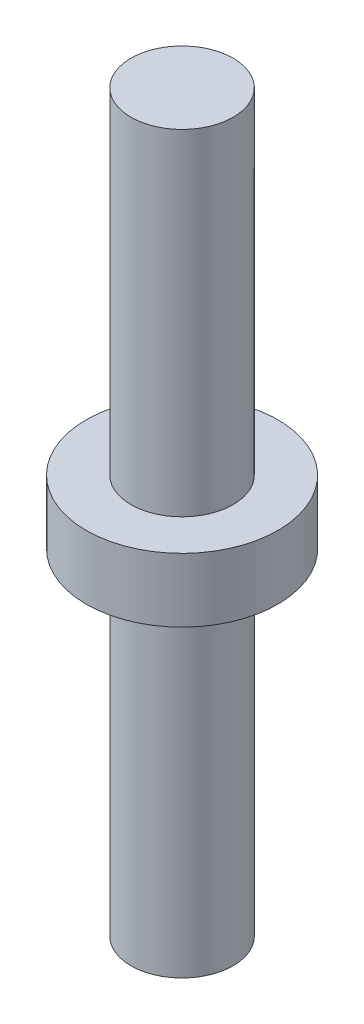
ISO-10303-21;
HEADER;
FILE_DESCRIPTION(('STEP AP214'),'2;1');
FILE_NAME('part.step','',(''),(''),'','','');
FILE_SCHEMA(('AUTOMOTIVE_DESIGN { 1 0 10303 214 1 1 1 1 }'));
ENDSEC;
DATA;
#1=APPLICATION_CONTEXT('core data for automotive mechanical design processes');
#2=APPLICATION_PROTOCOL_DEFINITION('international standard','automotive_design',2000,#1);
#3=PRODUCT_CONTEXT('',#1,'mechanical');
#4=PRODUCT('Part','Part','',(#3));
#5=PRODUCT_RELATED_PRODUCT_CATEGORY('part','',(#4));
#6=PRODUCT_DEFINITION_FORMATION('','',#4);
#7=PRODUCT_DEFINITION_CONTEXT('part definition',#1,'design');
#8=PRODUCT_DEFINITION('design','',#6,#7);
#9=PRODUCT_DEFINITION_SHAPE('','',#8);
#10=(LENGTH_UNIT() NAMED_UNIT(*) SI_UNIT(.MILLI.,.METRE.));
#11=(NAMED_UNIT(*) PLANE_ANGLE_UNIT() SI_UNIT($,.RADIAN.));
#12=(NAMED_UNIT(*) SI_UNIT($,.STERADIAN.) SOLID_ANGLE_UNIT());
#13=UNCERTAINTY_MEASURE_WITH_UNIT(LENGTH_MEASURE(1.E-05),#10,'distance_accuracy_value','');
#14=(GEOMETRIC_REPRESENTATION_CONTEXT(3) GLOBAL_UNCERTAINTY_ASSIGNED_CONTEXT((#13)) GLOBAL_UNIT_ASSIGNED_CONTEXT((#10,
#11,#12)) REPRESENTATION_CONTEXT('',''));
#15=CARTESIAN_POINT('',(0.,0.,0.));
#16=DIRECTION('',(0.,0.,1.));
#17=DIRECTION('',(1.,0.,0.));
#18=AXIS2_PLACEMENT_3D('',#15,#16,#17);
#19=CARTESIAN_POINT('',(0.,2.,0.));
#20=DIRECTION('',(0.,-1.,0.));
#21=DIRECTION('',(0.,0.,-1.));
#22=AXIS2_PLACEMENT_3D('',#19,#20,#21);
#23=CYLINDRICAL_SURFACE('',#22,3.);
#24=CARTESIAN_POINT('',(0.,2.,0.));
#25=DIRECTION('',(0.,1.,0.));
#26=DIRECTION('',(0.,0.,1.));
#27=AXIS2_PLACEMENT_3D('',#24,#25,#26);
#28=CIRCLE('',#27,3.);
#29=CARTESIAN_POINT('',(0.,2.,3.));
#30=VERTEX_POINT('',#29);
#31=EDGE_CURVE('E51',#30,#30,#28,.T.);
#32=ORIENTED_EDGE('',*,*,#31,.F.);
#33=EDGE_LOOP('',(#32));
#34=FACE_BOUND('',#33,.T.);
#35=CARTESIAN_POINT('',(0.,0.,0.));
#36=DIRECTION('',(0.,1.,0.));
#37=DIRECTION('',(0.,0.,1.));
#38=AXIS2_PLACEMENT_3D('',#35,#36,#37);
#39=CIRCLE('',#38,3.);
#40=CARTESIAN_POINT('',(0.,0.,3.));
#41=VERTEX_POINT('',#40);
#42=EDGE_CURVE('E42',#41,#41,#39,.T.);
#43=ORIENTED_EDGE('',*,*,#42,.T.);
#44=EDGE_LOOP('',(#43));
#45=FACE_BOUND('',#44,.T.);
#46=ADVANCED_FACE('F39',(#34,#45),#23,.T.);
#47=CARTESIAN_POINT('',(0.,2.,0.));
#48=DIRECTION('',(0.,1.,0.));
#49=DIRECTION('',(0.,0.,1.));
#50=AXIS2_PLACEMENT_3D('',#47,#48,#49);
#51=PLANE('',#50);
#52=CARTESIAN_POINT('',(0.,2.,0.));
#53=DIRECTION('',(0.,1.,0.));
#54=DIRECTION('',(0.,0.,1.));
#55=AXIS2_PLACEMENT_3D('',#52,#53,#54);
#56=CIRCLE('',#55,1.6);
#57=CARTESIAN_POINT('',(0.,2.,-1.6));
#58=VERTEX_POINT('',#57);
#59=EDGE_CURVE('E46',#58,#58,#56,.T.);
#60=ORIENTED_EDGE('',*,*,#59,.F.);
#61=EDGE_LOOP('',(#60));
#62=FACE_BOUND('',#61,.T.);
#63=ORIENTED_EDGE('',*,*,#31,.T.);
#64=EDGE_LOOP('',(#63));
#65=FACE_BOUND('',#64,.T.);
#66=ADVANCED_FACE('F68',(#62,#65),#51,.T.);
#67=CARTESIAN_POINT('',(0.,0.,0.));
#68=DIRECTION('',(0.,1.,0.));
#69=DIRECTION('',(0.,0.,1.));
#70=AXIS2_PLACEMENT_3D('',#67,#68,#69);
#71=PLANE('',#70);
#72=CARTESIAN_POINT('',(0.,0.,0.));
#73=DIRECTION('',(0.,-1.,0.));
#74=DIRECTION('',(0.,0.,-1.));
#75=AXIS2_PLACEMENT_3D('',#72,#73,#74);
#76=CIRCLE('',#75,1.6);
#77=CARTESIAN_POINT('',(0.,0.,1.6));
#78=VERTEX_POINT('',#77);
#79=EDGE_CURVE('E10',#78,#78,#76,.T.);
#80=ORIENTED_EDGE('',*,*,#79,.F.);
#81=EDGE_LOOP('',(#80));
#82=FACE_BOUND('',#81,.T.);
#83=ORIENTED_EDGE('',*,*,#42,.F.);
#84=EDGE_LOOP('',(#83));
#85=FACE_BOUND('',#84,.T.);
#86=ADVANCED_FACE('F65',(#82,#85),#71,.F.);
#87=CARTESIAN_POINT('',(0.,12.5,0.));
#88=DIRECTION('',(0.,-1.,0.));
#89=DIRECTION('',(0.,0.,-1.));
#90=AXIS2_PLACEMENT_3D('',#87,#88,#89);
#91=CYLINDRICAL_SURFACE('',#90,1.6);
#92=CARTESIAN_POINT('',(0.,12.5,0.));
#93=DIRECTION('',(0.,1.,0.));
#94=DIRECTION('',(0.,0.,1.));
#95=AXIS2_PLACEMENT_3D('',#92,#93,#94);
#96=CIRCLE('',#95,1.6);
#97=CARTESIAN_POINT('',(0.,12.5,-1.6));
#98=VERTEX_POINT('',#97);
#99=EDGE_CURVE('E56',#98,#98,#96,.T.);
#100=CARTESIAN_POINT('',(0.,12.5,-1.6));
#101=CARTESIAN_POINT('',(0.,12.390625,-1.6));
#102=CARTESIAN_POINT('',(0.,12.28125,-1.6));
#103=CARTESIAN_POINT('',(0.,12.0625,-1.6));
#104=CARTESIAN_POINT('',(0.,11.953125,-1.6));
#105=CARTESIAN_POINT('',(0.,11.734375,-1.6));
#106=CARTESIAN_POINT('',(0.,11.625,-1.6));
#107=CARTESIAN_POINT('',(0.,11.40625,-1.6));
#108=CARTESIAN_POINT('',(0.,11.296875,-1.6));
#109=CARTESIAN_POINT('',(0.,11.078125,-1.6));
#110=CARTESIAN_POINT('',(0.,10.96875,-1.6));
#111=CARTESIAN_POINT('',(0.,10.75,-1.6));
#112=CARTESIAN_POINT('',(0.,10.640625,-1.6));
#113=CARTESIAN_POINT('',(0.,10.421875,-1.6));
#114=CARTESIAN_POINT('',(0.,10.3125,-1.6));
#115=CARTESIAN_POINT('',(0.,10.09375,-1.6));
#116=CARTESIAN_POINT('',(0.,9.984375,-1.6));
#117=CARTESIAN_POINT('',(0.,9.765625,-1.6));
#118=CARTESIAN_POINT('',(0.,9.65625,-1.6));
#119=CARTESIAN_POINT('',(0.,9.4375,-1.6));
#120=CARTESIAN_POINT('',(0.,9.328125,-1.6));
#121=CARTESIAN_POINT('',(0.,9.109375,-1.6));
#122=CARTESIAN_POINT('',(0.,9.,-1.6));
#123=CARTESIAN_POINT('',(0.,8.78125,-1.6));
#124=CARTESIAN_POINT('',(0.,8.671875,-1.6));
#125=CARTESIAN_POINT('',(0.,8.453125,-1.6));
#126=CARTESIAN_POINT('',(0.,8.34375,-1.6));
#127=CARTESIAN_POINT('',(0.,8.125,-1.6));
#128=CARTESIAN_POINT('',(0.,8.015625,-1.6));
#129=CARTESIAN_POINT('',(0.,7.796875,-1.6));
#130=CARTESIAN_POINT('',(0.,7.6875,-1.6));
#131=CARTESIAN_POINT('',(0.,7.46875,-1.6));
#132=CARTESIAN_POINT('',(0.,7.359375,-1.6));
#133=CARTESIAN_POINT('',(0.,7.140625,-1.6));
#134=CARTESIAN_POINT('',(0.,7.03125,-1.6));
#135=CARTESIAN_POINT('',(0.,6.8125,-1.6));
#136=CARTESIAN_POINT('',(0.,6.703125,-1.6));
#137=CARTESIAN_POINT('',(0.,6.484375,-1.6));
#138=CARTESIAN_POINT('',(0.,6.375,-1.6));
#139=CARTESIAN_POINT('',(0.,6.15625,-1.6));
#140=CARTESIAN_POINT('',(0.,6.046875,-1.6));
#141=CARTESIAN_POINT('',(0.,5.828125,-1.6));
#142=CARTESIAN_POINT('',(0.,5.71875,-1.6));
#143=CARTESIAN_POINT('',(0.,5.5,-1.6));
#144=CARTESIAN_POINT('',(0.,5.390625,-1.6));
#145=CARTESIAN_POINT('',(0.,5.171875,-1.6));
#146=CARTESIAN_POINT('',(0.,5.0625,-1.6));
#147=CARTESIAN_POINT('',(0.,4.84375,-1.6));
#148=CARTESIAN_POINT('',(0.,4.734375,-1.6));
#149=CARTESIAN_POINT('',(0.,4.515625,-1.6));
#150=CARTESIAN_POINT('',(0.,4.40625,-1.6));
#151=CARTESIAN_POINT('',(0.,4.1875,-1.6));
#152=CARTESIAN_POINT('',(0.,4.078125,-1.6));
#153=CARTESIAN_POINT('',(0.,3.859375,-1.6));
#154=CARTESIAN_POINT('',(0.,3.75,-1.6));
#155=CARTESIAN_POINT('',(0.,3.53125,-1.6));
#156=CARTESIAN_POINT('',(0.,3.421875,-1.6));
#157=CARTESIAN_POINT('',(0.,3.203125,-1.6));
#158=CARTESIAN_POINT('',(0.,3.09375,-1.6));
#159=CARTESIAN_POINT('',(0.,2.875,-1.6));
#160=CARTESIAN_POINT('',(0.,2.765625,-1.6));
#161=CARTESIAN_POINT('',(0.,2.546875,-1.6));
#162=CARTESIAN_POINT('',(0.,2.4375,-1.6));
#163=CARTESIAN_POINT('',(0.,2.21875,-1.6));
#164=CARTESIAN_POINT('',(0.,2.109375,-1.6));
#165=CARTESIAN_POINT('',(0.,2.,-1.6));
#166=B_SPLINE_CURVE_WITH_KNOTS('',3,(#100,#101,#102,#103,#104,#105,#106,#107,#108,#109,#110,
#111,#112,#113,#114,#115,#116,#117,#118,#119,#120,#121,#122,#123,#124,#125,#126,#127,#128,#129,
#130,#131,#132,#133,#134,#135,#136,#137,#138,#139,#140,#141,#142,#143,#144,#145,#146,#147,#148,
#149,#150,#151,#152,#153,#154,#155,#156,#157,#158,#159,#160,#161,#162,#163,#164,#165),
.UNSPECIFIED.,.F.,.F.,(4,2,2,2,2,2,2,2,2,2,2,2,2,2,2,2,2,2,2,2,2,2,2,2,2,2,2,2,2,2,2,2,4),(0.,
0.328125,0.656250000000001,0.984375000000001,1.3125,1.640625,1.96875,2.296875,2.625,2.953125,
3.28125,3.609375,3.9375,4.265625,4.59375,4.921875,5.25,5.578125,5.90625,6.234375,6.5625,
6.890625,7.21875,7.546875,7.875,8.203125,8.53125,8.859375,9.1875,9.515625,9.84375,10.171875,
10.5),.UNSPECIFIED.);
#167=EDGE_CURVE('BSEAM67',#98,#58,#166,.T.);
#168=ORIENTED_EDGE('',*,*,#99,.F.);
#169=ORIENTED_EDGE('',*,*,#59,.T.);
#170=ORIENTED_EDGE('',*,*,#167,.T.);
#171=ORIENTED_EDGE('',*,*,#167,.F.);
#172=EDGE_LOOP('',(#168,#170,#169,#171));
#173=FACE_BOUND('',#172,.T.);
#174=ADVANCED_FACE('F67',(#173),#91,.T.);
#175=CARTESIAN_POINT('',(0.,12.5,0.));
#176=DIRECTION('',(0.,1.,0.));
#177=DIRECTION('',(0.,0.,1.));
#178=AXIS2_PLACEMENT_3D('',#175,#176,#177);
#179=PLANE('',#178);
#180=ORIENTED_EDGE('',*,*,#99,.T.);
#181=EDGE_LOOP('',(#180));
#182=FACE_BOUND('',#181,.T.);
#183=ADVANCED_FACE('F75',(#182),#179,.T.);
#184=CARTESIAN_POINT('',(0.,-10.5,0.));
#185=DIRECTION('',(0.,1.,0.));
#186=DIRECTION('',(0.,0.,1.));
#187=AXIS2_PLACEMENT_3D('',#184,#185,#186);
#188=CYLINDRICAL_SURFACE('',#187,1.6);
#189=CARTESIAN_POINT('',(0.,-10.5,0.));
#190=DIRECTION('',(0.,-1.,0.));
#191=DIRECTION('',(0.,0.,-1.));
#192=AXIS2_PLACEMENT_3D('',#189,#190,#191);
#193=CIRCLE('',#192,1.6);
#194=CARTESIAN_POINT('',(0.,-10.5,1.6));
#195=VERTEX_POINT('',#194);
#196=EDGE_CURVE('E55',#195,#195,#193,.T.);
#197=CARTESIAN_POINT('',(0.,-10.5,1.6));
#198=CARTESIAN_POINT('',(0.,-10.390625,1.6));
#199=CARTESIAN_POINT('',(0.,-10.28125,1.6));
#200=CARTESIAN_POINT('',(0.,-10.0625,1.6));
#201=CARTESIAN_POINT('',(0.,-9.953125,1.6));
#202=CARTESIAN_POINT('',(0.,-9.734375,1.6));
#203=CARTESIAN_POINT('',(0.,-9.625,1.6));
#204=CARTESIAN_POINT('',(0.,-9.40625,1.6));
#205=CARTESIAN_POINT('',(0.,-9.296875,1.6));
#206=CARTESIAN_POINT('',(0.,-9.078125,1.6));
#207=CARTESIAN_POINT('',(0.,-8.96875,1.6));
#208=CARTESIAN_POINT('',(0.,-8.75,1.6));
#209=CARTESIAN_POINT('',(0.,-8.640625,1.6));
#210=CARTESIAN_POINT('',(0.,-8.421875,1.6));
#211=CARTESIAN_POINT('',(0.,-8.3125,1.6));
#212=CARTESIAN_POINT('',(0.,-8.09375,1.6));
#213=CARTESIAN_POINT('',(0.,-7.984375,1.6));
#214=CARTESIAN_POINT('',(0.,-7.765625,1.6));
#215=CARTESIAN_POINT('',(0.,-7.65625,1.6));
#216=CARTESIAN_POINT('',(0.,-7.4375,1.6));
#217=CARTESIAN_POINT('',(0.,-7.328125,1.6));
#218=CARTESIAN_POINT('',(0.,-7.109375,1.6));
#219=CARTESIAN_POINT('',(0.,-7.,1.6));
#220=CARTESIAN_POINT('',(0.,-6.78125,1.6));
#221=CARTESIAN_POINT('',(0.,-6.671875,1.6));
#222=CARTESIAN_POINT('',(0.,-6.453125,1.6));
#223=CARTESIAN_POINT('',(0.,-6.34375,1.6));
#224=CARTESIAN_POINT('',(0.,-6.125,1.6));
#225=CARTESIAN_POINT('',(0.,-6.015625,1.6));
#226=CARTESIAN_POINT('',(0.,-5.796875,1.6));
#227=CARTESIAN_POINT('',(0.,-5.6875,1.6));
#228=CARTESIAN_POINT('',(0.,-5.46875,1.6));
#229=CARTESIAN_POINT('',(0.,-5.359375,1.6));
#230=CARTESIAN_POINT('',(0.,-5.140625,1.6));
#231=CARTESIAN_POINT('',(0.,-5.03125,1.6));
#232=CARTESIAN_POINT('',(0.,-4.8125,1.6));
#233=CARTESIAN_POINT('',(0.,-4.703125,1.6));
#234=CARTESIAN_POINT('',(0.,-4.484375,1.6));
#235=CARTESIAN_POINT('',(0.,-4.375,1.6));
#236=CARTESIAN_POINT('',(0.,-4.15625,1.6));
#237=CARTESIAN_POINT('',(0.,-4.046875,1.6));
#238=CARTESIAN_POINT('',(0.,-3.828125,1.6));
#239=CARTESIAN_POINT('',(0.,-3.71875,1.6));
#240=CARTESIAN_POINT('',(0.,-3.5,1.6));
#241=CARTESIAN_POINT('',(0.,-3.390625,1.6));
#242=CARTESIAN_POINT('',(0.,-3.171875,1.6));
#243=CARTESIAN_POINT('',(0.,-3.0625,1.6));
#244=CARTESIAN_POINT('',(0.,-2.84375,1.6));
#245=CARTESIAN_POINT('',(0.,-2.734375,1.6));
#246=CARTESIAN_POINT('',(0.,-2.515625,1.6));
#247=CARTESIAN_POINT('',(0.,-2.40625,1.6));
#248=CARTESIAN_POINT('',(0.,-2.1875,1.6));
#249=CARTESIAN_POINT('',(0.,-2.078125,1.6));
#250=CARTESIAN_POINT('',(0.,-1.859375,1.6));
#251=CARTESIAN_POINT('',(0.,-1.75,1.6));
#252=CARTESIAN_POINT('',(0.,-1.53125,1.6));
#253=CARTESIAN_POINT('',(0.,-1.421875,1.6));
#254=CARTESIAN_POINT('',(0.,-1.203125,1.6));
#255=CARTESIAN_POINT('',(0.,-1.09375,1.6));
#256=CARTESIAN_POINT('',(0.,-0.875000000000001,1.6));
#257=CARTESIAN_POINT('',(0.,-0.765625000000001,1.6));
#258=CARTESIAN_POINT('',(0.,-0.546875,1.6));
#259=CARTESIAN_POINT('',(0.,-0.4375,1.6));
#260=CARTESIAN_POINT('',(0.,-0.21875,1.6));
#261=CARTESIAN_POINT('',(0.,-0.109375,1.6));
#262=CARTESIAN_POINT('',(0.,0.,1.6));
#263=B_SPLINE_CURVE_WITH_KNOTS('',3,(#197,#198,#199,#200,#201,#202,#203,#204,#205,#206,#207,
#208,#209,#210,#211,#212,#213,#214,#215,#216,#217,#218,#219,#220,#221,#222,#223,#224,#225,#226,
#227,#228,#229,#230,#231,#232,#233,#234,#235,#236,#237,#238,#239,#240,#241,#242,#243,#244,#245,
#246,#247,#248,#249,#250,#251,#252,#253,#254,#255,#256,#257,#258,#259,#260,#261,#262),
.UNSPECIFIED.,.F.,.F.,(4,2,2,2,2,2,2,2,2,2,2,2,2,2,2,2,2,2,2,2,2,2,2,2,2,2,2,2,2,2,2,2,4),(0.,
0.328125,0.656250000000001,0.984375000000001,1.3125,1.640625,1.96875,2.296875,2.625,2.953125,
3.28125,3.609375,3.9375,4.265625,4.59375,4.921875,5.25,5.578125,5.90625,6.234375,6.5625,
6.890625,7.21875,7.546875,7.875,8.203125,8.53125,8.859375,9.1875,9.515625,9.84375,10.171875,
10.5),.UNSPECIFIED.);
#264=EDGE_CURVE('BSEAM100',#195,#78,#263,.T.);
#265=ORIENTED_EDGE('',*,*,#196,.F.);
#266=ORIENTED_EDGE('',*,*,#79,.T.);
#267=ORIENTED_EDGE('',*,*,#264,.T.);
#268=ORIENTED_EDGE('',*,*,#264,.F.);
#269=EDGE_LOOP('',(#265,#267,#266,#268));
#270=FACE_BOUND('',#269,.T.);
#271=ADVANCED_FACE('F100',(#270),#188,.T.);
#272=CARTESIAN_POINT('',(0.,-10.5,0.));
#273=DIRECTION('',(0.,-1.,0.));
#274=DIRECTION('',(0.,0.,-1.));
#275=AXIS2_PLACEMENT_3D('',#272,#273,#274);
#276=PLANE('',#275);
#277=ORIENTED_EDGE('',*,*,#196,.T.);
#278=EDGE_LOOP('',(#277));
#279=FACE_BOUND('',#278,.T.);
#280=ADVANCED_FACE('F112',(#279),#276,.T.);
#281=CLOSED_SHELL('',(#46,#66,#86,#174,#183,#271,#280));
#282=MANIFOLD_SOLID_BREP('B2',#281);
#283=ADVANCED_BREP_SHAPE_REPRESENTATION('',(#18,#282),#14);
#284=SHAPE_DEFINITION_REPRESENTATION(#9,#283);
ENDSEC;
END-ISO-10303-21;
